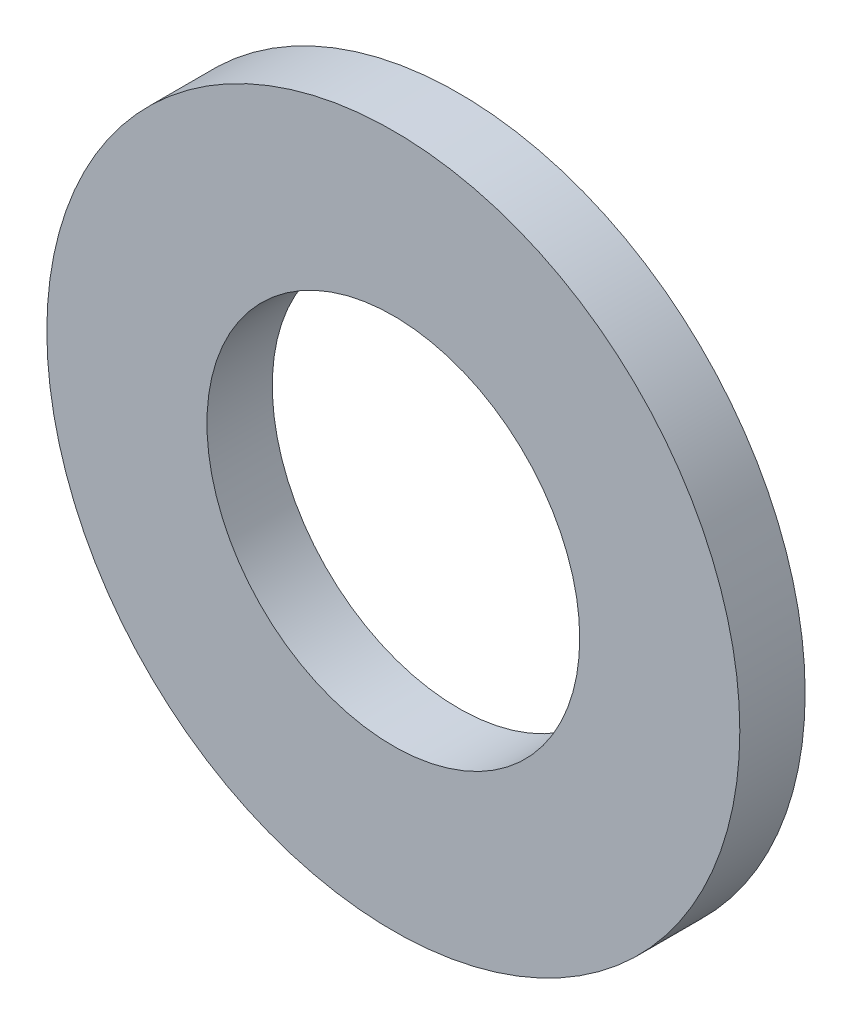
ISO-10303-21;
HEADER;
FILE_DESCRIPTION(('STEP AP214'),'2;1');
FILE_NAME('part.step','',(''),(''),'','','');
FILE_SCHEMA(('AUTOMOTIVE_DESIGN { 1 0 10303 214 1 1 1 1 }'));
ENDSEC;
DATA;
#1=APPLICATION_CONTEXT('core data for automotive mechanical design processes');
#2=APPLICATION_PROTOCOL_DEFINITION('international standard','automotive_design',2000,#1);
#3=PRODUCT_CONTEXT('',#1,'mechanical');
#4=PRODUCT('Part','Part','',(#3));
#5=PRODUCT_RELATED_PRODUCT_CATEGORY('part','',(#4));
#6=PRODUCT_DEFINITION_FORMATION('','',#4);
#7=PRODUCT_DEFINITION_CONTEXT('part definition',#1,'design');
#8=PRODUCT_DEFINITION('design','',#6,#7);
#9=PRODUCT_DEFINITION_SHAPE('','',#8);
#10=(LENGTH_UNIT() NAMED_UNIT(*) SI_UNIT(.MILLI.,.METRE.));
#11=(NAMED_UNIT(*) PLANE_ANGLE_UNIT() SI_UNIT($,.RADIAN.));
#12=(NAMED_UNIT(*) SI_UNIT($,.STERADIAN.) SOLID_ANGLE_UNIT());
#13=UNCERTAINTY_MEASURE_WITH_UNIT(LENGTH_MEASURE(1.E-05),#10,'distance_accuracy_value','');
#14=(GEOMETRIC_REPRESENTATION_CONTEXT(3) GLOBAL_UNCERTAINTY_ASSIGNED_CONTEXT((#13)) GLOBAL_UNIT_ASSIGNED_CONTEXT((#10,
#11,#12)) REPRESENTATION_CONTEXT('',''));
#15=CARTESIAN_POINT('',(0.,0.,0.));
#16=DIRECTION('',(0.,0.,1.));
#17=DIRECTION('',(1.,0.,0.));
#18=AXIS2_PLACEMENT_3D('',#15,#16,#17);
#19=CARTESIAN_POINT('',(0.,0.,1.49));
#20=DIRECTION('',(0.,0.,1.));
#21=DIRECTION('',(1.,0.,0.));
#22=AXIS2_PLACEMENT_3D('',#19,#20,#21);
#23=PLANE('',#22);
#24=CARTESIAN_POINT('',(0.,0.,1.49));
#25=DIRECTION('',(0.,0.,1.));
#26=DIRECTION('',(1.,0.,0.));
#27=AXIS2_PLACEMENT_3D('',#24,#25,#26);
#28=CIRCLE('',#27,7.9);
#29=CARTESIAN_POINT('',(7.9,0.,1.49));
#30=VERTEX_POINT('',#29);
#31=EDGE_CURVE('E10',#30,#30,#28,.T.);
#32=ORIENTED_EDGE('',*,*,#31,.T.);
#33=EDGE_LOOP('',(#32));
#34=FACE_BOUND('',#33,.T.);
#35=CARTESIAN_POINT('',(0.,0.,1.49));
#36=DIRECTION('',(0.,0.,1.));
#37=DIRECTION('',(1.,0.,0.));
#38=AXIS2_PLACEMENT_3D('',#35,#36,#37);
#39=CIRCLE('',#38,4.25);
#40=CARTESIAN_POINT('',(4.25,0.,1.49));
#41=VERTEX_POINT('',#40);
#42=EDGE_CURVE('E45',#41,#41,#39,.T.);
#43=ORIENTED_EDGE('',*,*,#42,.F.);
#44=EDGE_LOOP('',(#43));
#45=FACE_BOUND('',#44,.T.);
#46=ADVANCED_FACE('F34',(#34,#45),#23,.T.);
#47=CARTESIAN_POINT('',(0.,0.,0.));
#48=DIRECTION('',(0.,0.,1.));
#49=DIRECTION('',(1.,0.,0.));
#50=AXIS2_PLACEMENT_3D('',#47,#48,#49);
#51=PLANE('',#50);
#52=CARTESIAN_POINT('',(0.,0.,0.));
#53=DIRECTION('',(0.,0.,1.));
#54=DIRECTION('',(1.,0.,0.));
#55=AXIS2_PLACEMENT_3D('',#52,#53,#54);
#56=CIRCLE('',#55,7.9);
#57=CARTESIAN_POINT('',(7.9,0.,0.));
#58=VERTEX_POINT('',#57);
#59=EDGE_CURVE('E38',#58,#58,#56,.T.);
#60=ORIENTED_EDGE('',*,*,#59,.F.);
#61=EDGE_LOOP('',(#60));
#62=FACE_BOUND('',#61,.T.);
#63=CARTESIAN_POINT('',(0.,0.,0.));
#64=DIRECTION('',(0.,0.,1.));
#65=DIRECTION('',(1.,0.,0.));
#66=AXIS2_PLACEMENT_3D('',#63,#64,#65);
#67=CIRCLE('',#66,4.25);
#68=CARTESIAN_POINT('',(4.25,0.,0.));
#69=VERTEX_POINT('',#68);
#70=EDGE_CURVE('E47',#69,#69,#67,.T.);
#71=ORIENTED_EDGE('',*,*,#70,.T.);
#72=EDGE_LOOP('',(#71));
#73=FACE_BOUND('',#72,.T.);
#74=ADVANCED_FACE('F57',(#62,#73),#51,.F.);
#75=CARTESIAN_POINT('',(0.,0.,1.49));
#76=DIRECTION('',(0.,0.,-1.));
#77=DIRECTION('',(-1.,0.,0.));
#78=AXIS2_PLACEMENT_3D('',#75,#76,#77);
#79=CYLINDRICAL_SURFACE('',#78,7.9);
#80=ORIENTED_EDGE('',*,*,#31,.F.);
#81=EDGE_LOOP('',(#80));
#82=FACE_BOUND('',#81,.T.);
#83=ORIENTED_EDGE('',*,*,#59,.T.);
#84=EDGE_LOOP('',(#83));
#85=FACE_BOUND('',#84,.T.);
#86=ADVANCED_FACE('F36',(#82,#85),#79,.T.);
#87=CARTESIAN_POINT('',(0.,0.,1.49));
#88=DIRECTION('',(0.,0.,-1.));
#89=DIRECTION('',(-1.,0.,0.));
#90=AXIS2_PLACEMENT_3D('',#87,#88,#89);
#91=CYLINDRICAL_SURFACE('',#90,4.25);
#92=ORIENTED_EDGE('',*,*,#42,.T.);
#93=EDGE_LOOP('',(#92));
#94=FACE_BOUND('',#93,.T.);
#95=ORIENTED_EDGE('',*,*,#70,.F.);
#96=EDGE_LOOP('',(#95));
#97=FACE_BOUND('',#96,.T.);
#98=ADVANCED_FACE('F53',(#94,#97),#91,.F.);
#99=CLOSED_SHELL('',(#46,#74,#86,#98));
#100=MANIFOLD_SOLID_BREP('B2',#99);
#101=ADVANCED_BREP_SHAPE_REPRESENTATION('',(#18,#100),#14);
#102=SHAPE_DEFINITION_REPRESENTATION(#9,#101);
ENDSEC;
END-ISO-10303-21;
